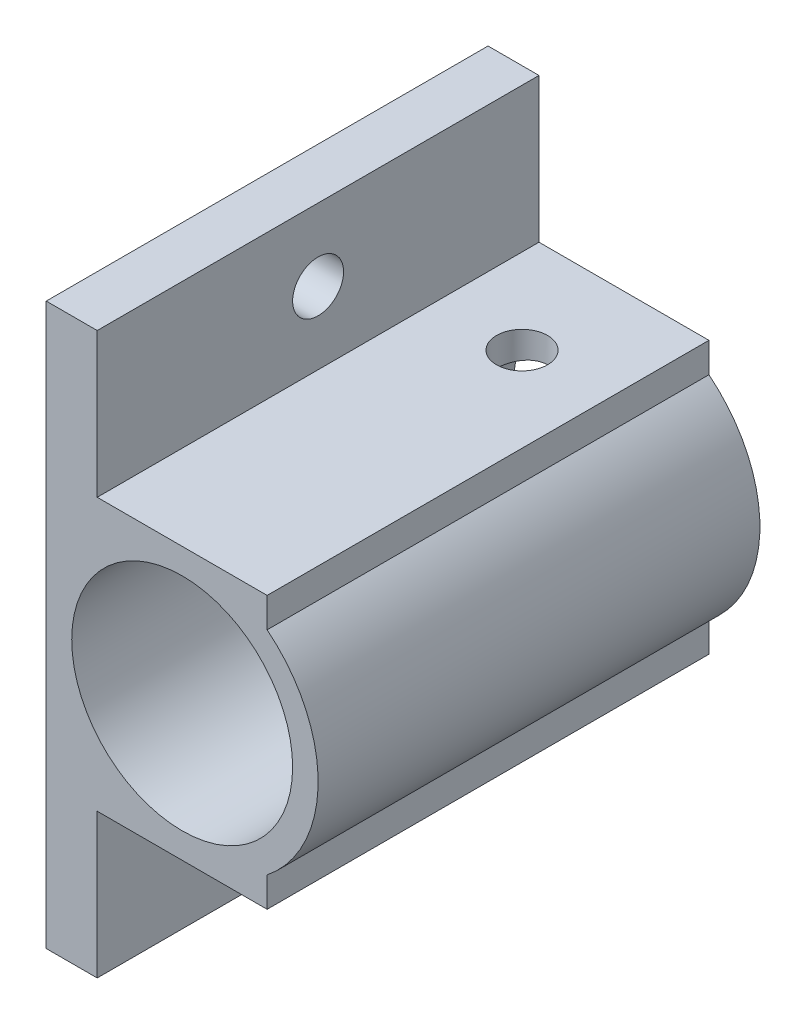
ISO-10303-21;
HEADER;
FILE_DESCRIPTION(('STEP AP214'),'2;1');
FILE_NAME('part.step','',(''),(''),'','','');
FILE_SCHEMA(('AUTOMOTIVE_DESIGN { 1 0 10303 214 1 1 1 1 }'));
ENDSEC;
DATA;
#1=APPLICATION_CONTEXT('core data for automotive mechanical design processes');
#2=APPLICATION_PROTOCOL_DEFINITION('international standard','automotive_design',2000,#1);
#3=PRODUCT_CONTEXT('',#1,'mechanical');
#4=PRODUCT('Part','Part','',(#3));
#5=PRODUCT_RELATED_PRODUCT_CATEGORY('part','',(#4));
#6=PRODUCT_DEFINITION_FORMATION('','',#4);
#7=PRODUCT_DEFINITION_CONTEXT('part definition',#1,'design');
#8=PRODUCT_DEFINITION('design','',#6,#7);
#9=PRODUCT_DEFINITION_SHAPE('','',#8);
#10=(LENGTH_UNIT() NAMED_UNIT(*) SI_UNIT(.MILLI.,.METRE.));
#11=(NAMED_UNIT(*) PLANE_ANGLE_UNIT() SI_UNIT($,.RADIAN.));
#12=(NAMED_UNIT(*) SI_UNIT($,.STERADIAN.) SOLID_ANGLE_UNIT());
#13=UNCERTAINTY_MEASURE_WITH_UNIT(LENGTH_MEASURE(1.E-05),#10,'distance_accuracy_value','');
#14=(GEOMETRIC_REPRESENTATION_CONTEXT(3) GLOBAL_UNCERTAINTY_ASSIGNED_CONTEXT((#13)) GLOBAL_UNIT_ASSIGNED_CONTEXT((#10,
#11,#12)) REPRESENTATION_CONTEXT('',''));
#15=CARTESIAN_POINT('',(0.,0.,0.));
#16=DIRECTION('',(0.,0.,1.));
#17=DIRECTION('',(1.,0.,0.));
#18=AXIS2_PLACEMENT_3D('',#15,#16,#17);
#19=CARTESIAN_POINT('',(-5.,0.,26.));
#20=DIRECTION('',(1.,0.,0.));
#21=DIRECTION('',(0.,1.,0.));
#22=AXIS2_PLACEMENT_3D('',#19,#20,#21);
#23=PLANE('',#22);
#24=CARTESIAN_POINT('',(-5.,-12.25,13.));
#25=DIRECTION('',(1.,0.,0.));
#26=DIRECTION('',(0.,1.,0.));
#27=AXIS2_PLACEMENT_3D('',#24,#25,#26);
#28=CIRCLE('',#27,1.5);
#29=CARTESIAN_POINT('',(-5.,-10.75,13.));
#30=VERTEX_POINT('',#29);
#31=EDGE_CURVE('E228',#30,#30,#28,.T.);
#32=ORIENTED_EDGE('',*,*,#31,.F.);
#33=EDGE_LOOP('',(#32));
#34=FACE_BOUND('',#33,.T.);
#35=DIRECTION('',(0.,-1.,0.));
#36=VECTOR('',#35,1.);
#37=CARTESIAN_POINT('',(-5.,0.,0.));
#38=LINE('',#37,#36);
#39=CARTESIAN_POINT('',(-5.,-8.,0.));
#40=VERTEX_POINT('',#39);
#41=CARTESIAN_POINT('',(-5.,-16.5,0.));
#42=VERTEX_POINT('',#41);
#43=EDGE_CURVE('E149',#40,#42,#38,.T.);
#44=ORIENTED_EDGE('',*,*,#43,.F.);
#45=DIRECTION('',(0.,0.,-1.));
#46=VECTOR('',#45,1.);
#47=CARTESIAN_POINT('',(-5.,-8.,26.));
#48=LINE('',#47,#46);
#49=CARTESIAN_POINT('',(-5.,-8.,26.));
#50=VERTEX_POINT('',#49);
#51=EDGE_CURVE('E11',#50,#40,#48,.T.);
#52=ORIENTED_EDGE('',*,*,#51,.F.);
#53=DIRECTION('',(0.,-1.,0.));
#54=VECTOR('',#53,1.);
#55=CARTESIAN_POINT('',(-5.,0.,26.));
#56=LINE('',#55,#54);
#57=CARTESIAN_POINT('',(-5.,-16.5,26.));
#58=VERTEX_POINT('',#57);
#59=EDGE_CURVE('E178',#50,#58,#56,.T.);
#60=ORIENTED_EDGE('',*,*,#59,.T.);
#61=DIRECTION('',(0.,0.,-1.));
#62=VECTOR('',#61,1.);
#63=CARTESIAN_POINT('',(-5.,-16.5,26.));
#64=LINE('',#63,#62);
#65=EDGE_CURVE('E54',#58,#42,#64,.T.);
#66=ORIENTED_EDGE('',*,*,#65,.T.);
#67=EDGE_LOOP('',(#44,#52,#60,#66));
#68=FACE_BOUND('',#67,.T.);
#69=ADVANCED_FACE('F36',(#34,#68),#23,.T.);
#70=CARTESIAN_POINT('',(0.,-8.,26.));
#71=DIRECTION('',(0.,1.,0.));
#72=DIRECTION('',(0.,0.,1.));
#73=AXIS2_PLACEMENT_3D('',#70,#71,#72);
#74=PLANE('',#73);
#75=DIRECTION('',(1.,0.,0.));
#76=VECTOR('',#75,1.);
#77=CARTESIAN_POINT('',(0.,-8.,0.));
#78=LINE('',#77,#76);
#79=CARTESIAN_POINT('',(5.,-8.,0.));
#80=VERTEX_POINT('',#79);
#81=EDGE_CURVE('E151',#40,#80,#78,.T.);
#82=ORIENTED_EDGE('',*,*,#81,.T.);
#83=DIRECTION('',(0.,0.,-1.));
#84=VECTOR('',#83,1.);
#85=CARTESIAN_POINT('',(5.,-8.,26.));
#86=LINE('',#85,#84);
#87=CARTESIAN_POINT('',(5.,-8.,26.));
#88=VERTEX_POINT('',#87);
#89=EDGE_CURVE('E45',#88,#80,#86,.T.);
#90=ORIENTED_EDGE('',*,*,#89,.F.);
#91=DIRECTION('',(1.,0.,0.));
#92=VECTOR('',#91,1.);
#93=CARTESIAN_POINT('',(0.,-8.,26.));
#94=LINE('',#93,#92);
#95=EDGE_CURVE('E276',#50,#88,#94,.T.);
#96=ORIENTED_EDGE('',*,*,#95,.F.);
#97=ORIENTED_EDGE('',*,*,#51,.T.);
#98=EDGE_LOOP('',(#82,#90,#96,#97));
#99=FACE_BOUND('',#98,.T.);
#100=ADVANCED_FACE('F219',(#99),#74,.F.);
#101=CARTESIAN_POINT('',(5.,0.,26.));
#102=DIRECTION('',(1.,0.,0.));
#103=DIRECTION('',(0.,1.,0.));
#104=AXIS2_PLACEMENT_3D('',#101,#102,#103);
#105=PLANE('',#104);
#106=DIRECTION('',(0.,-1.,0.));
#107=VECTOR('',#106,1.);
#108=CARTESIAN_POINT('',(5.,0.,0.));
#109=LINE('',#108,#107);
#110=CARTESIAN_POINT('',(5.,-6.2449979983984,0.));
#111=VERTEX_POINT('',#110);
#112=EDGE_CURVE('E155',#111,#80,#109,.T.);
#113=ORIENTED_EDGE('',*,*,#112,.F.);
#114=DIRECTION('',(0.,0.,-1.));
#115=VECTOR('',#114,1.);
#116=CARTESIAN_POINT('',(5.,-6.2449979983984,26.));
#117=LINE('',#116,#115);
#118=CARTESIAN_POINT('',(5.,-6.2449979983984,26.));
#119=VERTEX_POINT('',#118);
#120=EDGE_CURVE('E188',#119,#111,#117,.T.);
#121=ORIENTED_EDGE('',*,*,#120,.F.);
#122=DIRECTION('',(0.,-1.,0.));
#123=VECTOR('',#122,1.);
#124=CARTESIAN_POINT('',(5.,0.,26.));
#125=LINE('',#124,#123);
#126=EDGE_CURVE('E274',#119,#88,#125,.T.);
#127=ORIENTED_EDGE('',*,*,#126,.T.);
#128=ORIENTED_EDGE('',*,*,#89,.T.);
#129=EDGE_LOOP('',(#113,#121,#127,#128));
#130=FACE_BOUND('',#129,.T.);
#131=ADVANCED_FACE('F224',(#130),#105,.T.);
#132=CARTESIAN_POINT('',(0.,0.,26.));
#133=DIRECTION('',(0.,0.,-1.));
#134=DIRECTION('',(-1.,0.,0.));
#135=AXIS2_PLACEMENT_3D('',#132,#133,#134);
#136=CYLINDRICAL_SURFACE('',#135,8.);
#137=CARTESIAN_POINT('',(0.,0.,0.));
#138=DIRECTION('',(0.,0.,1.));
#139=DIRECTION('',(1.,0.,0.));
#140=AXIS2_PLACEMENT_3D('',#137,#138,#139);
#141=CIRCLE('',#140,8.);
#142=CARTESIAN_POINT('',(5.,6.2449979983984,0.));
#143=VERTEX_POINT('',#142);
#144=EDGE_CURVE('E158',#111,#143,#141,.T.);
#145=ORIENTED_EDGE('',*,*,#144,.T.);
#146=DIRECTION('',(0.,0.,-1.));
#147=VECTOR('',#146,1.);
#148=CARTESIAN_POINT('',(5.,6.2449979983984,26.));
#149=LINE('',#148,#147);
#150=CARTESIAN_POINT('',(5.,6.2449979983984,26.));
#151=VERTEX_POINT('',#150);
#152=EDGE_CURVE('E186',#151,#143,#149,.T.);
#153=ORIENTED_EDGE('',*,*,#152,.F.);
#154=CARTESIAN_POINT('',(0.,0.,26.));
#155=DIRECTION('',(0.,0.,1.));
#156=DIRECTION('',(1.,0.,0.));
#157=AXIS2_PLACEMENT_3D('',#154,#155,#156);
#158=CIRCLE('',#157,8.);
#159=EDGE_CURVE('E270',#119,#151,#158,.T.);
#160=ORIENTED_EDGE('',*,*,#159,.F.);
#161=ORIENTED_EDGE('',*,*,#120,.T.);
#162=EDGE_LOOP('',(#145,#153,#160,#161));
#163=FACE_BOUND('',#162,.T.);
#164=ADVANCED_FACE('F253',(#163),#136,.T.);
#165=CARTESIAN_POINT('',(5.,0.,26.));
#166=DIRECTION('',(1.,0.,0.));
#167=DIRECTION('',(0.,1.,0.));
#168=AXIS2_PLACEMENT_3D('',#165,#166,#167);
#169=PLANE('',#168);
#170=DIRECTION('',(0.,-1.,0.));
#171=VECTOR('',#170,1.);
#172=CARTESIAN_POINT('',(5.,0.,0.));
#173=LINE('',#172,#171);
#174=CARTESIAN_POINT('',(5.,8.,0.));
#175=VERTEX_POINT('',#174);
#176=EDGE_CURVE('E161',#175,#143,#173,.T.);
#177=ORIENTED_EDGE('',*,*,#176,.F.);
#178=DIRECTION('',(0.,0.,-1.));
#179=VECTOR('',#178,1.);
#180=CARTESIAN_POINT('',(5.,8.,26.));
#181=LINE('',#180,#179);
#182=CARTESIAN_POINT('',(5.,8.,26.));
#183=VERTEX_POINT('',#182);
#184=EDGE_CURVE('E184',#183,#175,#181,.T.);
#185=ORIENTED_EDGE('',*,*,#184,.F.);
#186=DIRECTION('',(0.,-1.,0.));
#187=VECTOR('',#186,1.);
#188=CARTESIAN_POINT('',(5.,0.,26.));
#189=LINE('',#188,#187);
#190=EDGE_CURVE('E273',#183,#151,#189,.T.);
#191=ORIENTED_EDGE('',*,*,#190,.T.);
#192=ORIENTED_EDGE('',*,*,#152,.T.);
#193=EDGE_LOOP('',(#177,#185,#191,#192));
#194=FACE_BOUND('',#193,.T.);
#195=ADVANCED_FACE('F249',(#194),#169,.T.);
#196=CARTESIAN_POINT('',(0.,8.,26.));
#197=DIRECTION('',(0.,1.,0.));
#198=DIRECTION('',(0.,0.,1.));
#199=AXIS2_PLACEMENT_3D('',#196,#197,#198);
#200=PLANE('',#199);
#201=CARTESIAN_POINT('',(0.,8.,6.));
#202=DIRECTION('',(0.,1.,0.));
#203=DIRECTION('',(0.,0.,1.));
#204=AXIS2_PLACEMENT_3D('',#201,#202,#203);
#205=CIRCLE('',#204,1.5);
#206=CARTESIAN_POINT('',(0.,8.,7.5));
#207=VERTEX_POINT('',#206);
#208=EDGE_CURVE('E197',#207,#207,#205,.T.);
#209=ORIENTED_EDGE('',*,*,#208,.F.);
#210=EDGE_LOOP('',(#209));
#211=FACE_BOUND('',#210,.T.);
#212=DIRECTION('',(1.,0.,0.));
#213=VECTOR('',#212,1.);
#214=CARTESIAN_POINT('',(0.,8.,0.));
#215=LINE('',#214,#213);
#216=CARTESIAN_POINT('',(-5.,8.,0.));
#217=VERTEX_POINT('',#216);
#218=EDGE_CURVE('E164',#217,#175,#215,.T.);
#219=ORIENTED_EDGE('',*,*,#218,.F.);
#220=DIRECTION('',(0.,0.,-1.));
#221=VECTOR('',#220,1.);
#222=CARTESIAN_POINT('',(-5.,8.,26.));
#223=LINE('',#222,#221);
#224=CARTESIAN_POINT('',(-5.,8.,26.));
#225=VERTEX_POINT('',#224);
#226=EDGE_CURVE('E182',#225,#217,#223,.T.);
#227=ORIENTED_EDGE('',*,*,#226,.F.);
#228=DIRECTION('',(1.,0.,0.));
#229=VECTOR('',#228,1.);
#230=CARTESIAN_POINT('',(0.,8.,26.));
#231=LINE('',#230,#229);
#232=EDGE_CURVE('E282',#225,#183,#231,.T.);
#233=ORIENTED_EDGE('',*,*,#232,.T.);
#234=ORIENTED_EDGE('',*,*,#184,.T.);
#235=EDGE_LOOP('',(#219,#227,#233,#234));
#236=FACE_BOUND('',#235,.T.);
#237=ADVANCED_FACE('F245',(#211,#236),#200,.T.);
#238=CARTESIAN_POINT('',(-5.,0.,26.));
#239=DIRECTION('',(-1.,0.,0.));
#240=DIRECTION('',(0.,-1.,0.));
#241=AXIS2_PLACEMENT_3D('',#238,#239,#240);
#242=PLANE('',#241);
#243=CARTESIAN_POINT('',(-5.,12.25,13.));
#244=DIRECTION('',(1.,0.,0.));
#245=DIRECTION('',(0.,1.,0.));
#246=AXIS2_PLACEMENT_3D('',#243,#244,#245);
#247=CIRCLE('',#246,1.5);
#248=CARTESIAN_POINT('',(-5.,13.75,13.));
#249=VERTEX_POINT('',#248);
#250=EDGE_CURVE('E292',#249,#249,#247,.T.);
#251=ORIENTED_EDGE('',*,*,#250,.F.);
#252=EDGE_LOOP('',(#251));
#253=FACE_BOUND('',#252,.T.);
#254=DIRECTION('',(0.,1.,0.));
#255=VECTOR('',#254,1.);
#256=CARTESIAN_POINT('',(-5.,0.,0.));
#257=LINE('',#256,#255);
#258=CARTESIAN_POINT('',(-5.,16.5,0.));
#259=VERTEX_POINT('',#258);
#260=EDGE_CURVE('E167',#217,#259,#257,.T.);
#261=ORIENTED_EDGE('',*,*,#260,.T.);
#262=DIRECTION('',(0.,0.,-1.));
#263=VECTOR('',#262,1.);
#264=CARTESIAN_POINT('',(-5.,16.5,26.));
#265=LINE('',#264,#263);
#266=CARTESIAN_POINT('',(-5.,16.5,26.));
#267=VERTEX_POINT('',#266);
#268=EDGE_CURVE('E138',#267,#259,#265,.T.);
#269=ORIENTED_EDGE('',*,*,#268,.F.);
#270=DIRECTION('',(0.,1.,0.));
#271=VECTOR('',#270,1.);
#272=CARTESIAN_POINT('',(-5.,0.,26.));
#273=LINE('',#272,#271);
#274=EDGE_CURVE('E126',#225,#267,#273,.T.);
#275=ORIENTED_EDGE('',*,*,#274,.F.);
#276=ORIENTED_EDGE('',*,*,#226,.T.);
#277=EDGE_LOOP('',(#261,#269,#275,#276));
#278=FACE_BOUND('',#277,.T.);
#279=ADVANCED_FACE('F242',(#253,#278),#242,.F.);
#280=CARTESIAN_POINT('',(0.,16.5,26.));
#281=DIRECTION('',(0.,-1.,0.));
#282=DIRECTION('',(0.,0.,-1.));
#283=AXIS2_PLACEMENT_3D('',#280,#281,#282);
#284=PLANE('',#283);
#285=DIRECTION('',(-1.,0.,0.));
#286=VECTOR('',#285,1.);
#287=CARTESIAN_POINT('',(0.,16.5,0.));
#288=LINE('',#287,#286);
#289=CARTESIAN_POINT('',(-8.,16.5,0.));
#290=VERTEX_POINT('',#289);
#291=EDGE_CURVE('E135',#259,#290,#288,.T.);
#292=ORIENTED_EDGE('',*,*,#291,.T.);
#293=DIRECTION('',(0.,0.,-1.));
#294=VECTOR('',#293,1.);
#295=CARTESIAN_POINT('',(-8.,16.5,26.));
#296=LINE('',#295,#294);
#297=CARTESIAN_POINT('',(-8.,16.5,26.));
#298=VERTEX_POINT('',#297);
#299=EDGE_CURVE('E132',#298,#290,#296,.T.);
#300=ORIENTED_EDGE('',*,*,#299,.F.);
#301=DIRECTION('',(-1.,0.,0.));
#302=VECTOR('',#301,1.);
#303=CARTESIAN_POINT('',(0.,16.5,26.));
#304=LINE('',#303,#302);
#305=EDGE_CURVE('E116',#267,#298,#304,.T.);
#306=ORIENTED_EDGE('',*,*,#305,.F.);
#307=ORIENTED_EDGE('',*,*,#268,.T.);
#308=EDGE_LOOP('',(#292,#300,#306,#307));
#309=FACE_BOUND('',#308,.T.);
#310=ADVANCED_FACE('F133',(#309),#284,.F.);
#311=CARTESIAN_POINT('',(-8.,0.,26.));
#312=DIRECTION('',(1.,0.,0.));
#313=DIRECTION('',(0.,1.,0.));
#314=AXIS2_PLACEMENT_3D('',#311,#312,#313);
#315=PLANE('',#314);
#316=CARTESIAN_POINT('',(-8.,12.25,13.));
#317=DIRECTION('',(1.,0.,0.));
#318=DIRECTION('',(0.,1.,0.));
#319=AXIS2_PLACEMENT_3D('',#316,#317,#318);
#320=CIRCLE('',#319,1.5);
#321=CARTESIAN_POINT('',(-8.,13.75,13.));
#322=VERTEX_POINT('',#321);
#323=EDGE_CURVE('E39',#322,#322,#320,.T.);
#324=ORIENTED_EDGE('',*,*,#323,.T.);
#325=EDGE_LOOP('',(#324));
#326=FACE_BOUND('',#325,.T.);
#327=CARTESIAN_POINT('',(-8.,-12.25,13.));
#328=DIRECTION('',(1.,0.,0.));
#329=DIRECTION('',(0.,1.,0.));
#330=AXIS2_PLACEMENT_3D('',#327,#328,#329);
#331=CIRCLE('',#330,1.5);
#332=CARTESIAN_POINT('',(-8.,-10.75,13.));
#333=VERTEX_POINT('',#332);
#334=EDGE_CURVE('E198',#333,#333,#331,.T.);
#335=ORIENTED_EDGE('',*,*,#334,.T.);
#336=EDGE_LOOP('',(#335));
#337=FACE_BOUND('',#336,.T.);
#338=DIRECTION('',(0.,-1.,0.));
#339=VECTOR('',#338,1.);
#340=CARTESIAN_POINT('',(-8.,0.,0.));
#341=LINE('',#340,#339);
#342=CARTESIAN_POINT('',(-8.,-16.5,0.));
#343=VERTEX_POINT('',#342);
#344=EDGE_CURVE('E170',#290,#343,#341,.T.);
#345=ORIENTED_EDGE('',*,*,#344,.T.);
#346=DIRECTION('',(0.,0.,-1.));
#347=VECTOR('',#346,1.);
#348=CARTESIAN_POINT('',(-8.,-16.5,26.));
#349=LINE('',#348,#347);
#350=CARTESIAN_POINT('',(-8.,-16.5,26.));
#351=VERTEX_POINT('',#350);
#352=EDGE_CURVE('E86',#351,#343,#349,.T.);
#353=ORIENTED_EDGE('',*,*,#352,.F.);
#354=DIRECTION('',(0.,-1.,0.));
#355=VECTOR('',#354,1.);
#356=CARTESIAN_POINT('',(-8.,0.,26.));
#357=LINE('',#356,#355);
#358=EDGE_CURVE('E123',#298,#351,#357,.T.);
#359=ORIENTED_EDGE('',*,*,#358,.F.);
#360=ORIENTED_EDGE('',*,*,#299,.T.);
#361=EDGE_LOOP('',(#345,#353,#359,#360));
#362=FACE_BOUND('',#361,.T.);
#363=ADVANCED_FACE('F140',(#326,#337,#362),#315,.F.);
#364=CARTESIAN_POINT('',(0.,-16.5,26.));
#365=DIRECTION('',(0.,-1.,0.));
#366=DIRECTION('',(0.,0.,-1.));
#367=AXIS2_PLACEMENT_3D('',#364,#365,#366);
#368=PLANE('',#367);
#369=DIRECTION('',(-1.,0.,0.));
#370=VECTOR('',#369,1.);
#371=CARTESIAN_POINT('',(0.,-16.5,0.));
#372=LINE('',#371,#370);
#373=EDGE_CURVE('E172',#42,#343,#372,.T.);
#374=ORIENTED_EDGE('',*,*,#373,.F.);
#375=ORIENTED_EDGE('',*,*,#65,.F.);
#376=DIRECTION('',(-1.,0.,0.));
#377=VECTOR('',#376,1.);
#378=CARTESIAN_POINT('',(0.,-16.5,26.));
#379=LINE('',#378,#377);
#380=EDGE_CURVE('E141',#58,#351,#379,.T.);
#381=ORIENTED_EDGE('',*,*,#380,.T.);
#382=ORIENTED_EDGE('',*,*,#352,.T.);
#383=EDGE_LOOP('',(#374,#375,#381,#382));
#384=FACE_BOUND('',#383,.T.);
#385=ADVANCED_FACE('F230',(#384),#368,.T.);
#386=CARTESIAN_POINT('',(0.,0.,26.));
#387=DIRECTION('',(0.,0.,-1.));
#388=DIRECTION('',(-1.,0.,0.));
#389=AXIS2_PLACEMENT_3D('',#386,#387,#388);
#390=CYLINDRICAL_SURFACE('',#389,6.5);
#391=CARTESIAN_POINT('',(0.,6.5,7.5));
#392=CARTESIAN_POINT('',(-0.0830761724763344,6.49999849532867,7.49999733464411));
#393=CARTESIAN_POINT('',(-0.166183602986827,6.49839124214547,7.49307507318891));
#394=CARTESIAN_POINT('',(-0.330029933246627,6.49213500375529,7.46560235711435));
#395=CARTESIAN_POINT('',(-0.410767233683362,6.48748401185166,7.4450429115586));
#396=CARTESIAN_POINT('',(-0.567482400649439,6.47565710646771,7.39098030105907));
#397=CARTESIAN_POINT('',(-0.643465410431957,6.46848397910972,7.35749141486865));
#398=CARTESIAN_POINT('',(-0.788732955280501,6.45238316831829,7.27856773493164));
#399=CARTESIAN_POINT('',(-0.858017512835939,6.44345549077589,7.23313298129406));
#400=CARTESIAN_POINT('',(-0.989152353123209,6.42464323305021,7.13075474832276));
#401=CARTESIAN_POINT('',(-1.05086679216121,6.41474568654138,7.07363963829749));
#402=CARTESIAN_POINT('',(-1.16393060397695,6.39519859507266,6.94989007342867));
#403=CARTESIAN_POINT('',(-1.2152789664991,6.38554907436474,6.88325469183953));
#404=CARTESIAN_POINT('',(-1.3067669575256,6.36746174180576,6.74133307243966));
#405=CARTESIAN_POINT('',(-1.34675925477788,6.35904049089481,6.66594955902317));
#406=CARTESIAN_POINT('',(-1.41345395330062,6.34455046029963,6.50930490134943));
#407=CARTESIAN_POINT('',(-1.44015813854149,6.33848136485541,6.4280445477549));
#408=CARTESIAN_POINT('',(-1.4790642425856,6.32951534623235,6.26343419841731));
#409=CARTESIAN_POINT('',(-1.49150809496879,6.32656557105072,6.1801443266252));
#410=CARTESIAN_POINT('',(-1.50229307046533,6.32401364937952,6.01261091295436));
#411=CARTESIAN_POINT('',(-1.50063613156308,6.32441104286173,5.92836750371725));
#412=CARTESIAN_POINT('',(-1.48346063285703,6.32846083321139,5.7631371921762));
#413=CARTESIAN_POINT('',(-1.46822575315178,6.33204661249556,5.68211891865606));
#414=CARTESIAN_POINT('',(-1.42477741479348,6.34196351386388,5.52382020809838));
#415=CARTESIAN_POINT('',(-1.39656315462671,6.34829480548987,5.44654000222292));
#416=CARTESIAN_POINT('',(-1.32770349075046,6.36305332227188,5.29712732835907));
#417=CARTESIAN_POINT('',(-1.28695129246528,6.37149843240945,5.22504591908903));
#418=CARTESIAN_POINT('',(-1.19424748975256,6.38952239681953,5.08864076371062));
#419=CARTESIAN_POINT('',(-1.1422941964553,6.39910142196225,5.02431818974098));
#420=CARTESIAN_POINT('',(-1.02717321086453,6.41859777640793,4.90362604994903));
#421=CARTESIAN_POINT('',(-0.963764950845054,6.42851768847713,4.84748611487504));
#422=CARTESIAN_POINT('',(-0.828318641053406,6.44736816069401,4.74659692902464));
#423=CARTESIAN_POINT('',(-0.75628039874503,6.45629869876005,4.70184793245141));
#424=CARTESIAN_POINT('',(-0.605321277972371,6.47219854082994,4.62494408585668));
#425=CARTESIAN_POINT('',(-0.526383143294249,6.47916273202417,4.59282198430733));
#426=CARTESIAN_POINT('',(-0.364032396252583,6.49030757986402,4.54236385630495));
#427=CARTESIAN_POINT('',(-0.280620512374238,6.49448868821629,4.52402559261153));
#428=CARTESIAN_POINT('',(-0.11365732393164,6.49953102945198,4.50199584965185));
#429=CARTESIAN_POINT('',(-0.030149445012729,6.50046326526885,4.49799106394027));
#430=CARTESIAN_POINT('',(0.136342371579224,6.49910299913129,4.50388901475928));
#431=CARTESIAN_POINT('',(0.219326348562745,6.49681074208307,4.513790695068));
#432=CARTESIAN_POINT('',(0.381357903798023,6.48930412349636,4.54696119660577));
#433=CARTESIAN_POINT('',(0.4604414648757,6.48412623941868,4.57006324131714));
#434=CARTESIAN_POINT('',(0.613609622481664,6.47142910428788,4.62879158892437));
#435=CARTESIAN_POINT('',(0.687693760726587,6.4639096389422,4.66441903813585));
#436=CARTESIAN_POINT('',(0.830037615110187,6.44718996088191,4.74782264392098));
#437=CARTESIAN_POINT('',(0.898188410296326,6.43796535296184,4.7957796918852));
#438=CARTESIAN_POINT('',(1.02558718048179,6.41890391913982,4.90224561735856));
#439=CARTESIAN_POINT('',(1.08483385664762,6.40906700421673,4.96075603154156));
#440=CARTESIAN_POINT('',(1.19400102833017,6.38964047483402,5.08811238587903));
#441=CARTESIAN_POINT('',(1.24370343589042,6.3800601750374,5.1571469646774));
#442=CARTESIAN_POINT('',(1.33081235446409,6.36246188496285,5.30276588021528));
#443=CARTESIAN_POINT('',(1.3682194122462,6.35444382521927,5.37934988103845));
#444=CARTESIAN_POINT('',(1.42941066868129,6.34095951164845,5.53747598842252));
#445=CARTESIAN_POINT('',(1.45327404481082,6.33547846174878,5.61898612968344));
#446=CARTESIAN_POINT('',(1.48692530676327,6.3276660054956,5.78500399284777));
#447=CARTESIAN_POINT('',(1.49671574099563,6.32533402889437,5.86951116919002));
#448=CARTESIAN_POINT('',(1.50182536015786,6.32412253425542,6.03691822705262));
#449=CARTESIAN_POINT('',(1.49749127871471,6.32516029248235,6.11980711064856));
#450=CARTESIAN_POINT('',(1.47525685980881,6.33038270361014,6.28363867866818));
#451=CARTESIAN_POINT('',(1.45735672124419,6.33456731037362,6.36458139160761));
#452=CARTESIAN_POINT('',(1.40867420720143,6.34556939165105,6.52190991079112));
#453=CARTESIAN_POINT('',(1.37794771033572,6.35237543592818,6.59831386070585));
#454=CARTESIAN_POINT('',(1.304530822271,6.36785683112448,6.74493180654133));
#455=CARTESIAN_POINT('',(1.26183902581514,6.37653240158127,6.81514507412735));
#456=CARTESIAN_POINT('',(1.16457679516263,6.39501829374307,6.94908552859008));
#457=CARTESIAN_POINT('',(1.10976162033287,6.4048496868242,7.01263211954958));
#458=CARTESIAN_POINT('',(0.990297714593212,6.42440402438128,7.12973824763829));
#459=CARTESIAN_POINT('',(0.925646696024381,6.43412694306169,7.18329545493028));
#460=CARTESIAN_POINT('',(0.787191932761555,6.45253999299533,7.27966726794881));
#461=CARTESIAN_POINT('',(0.713266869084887,6.46121270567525,7.32231111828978));
#462=CARTESIAN_POINT('',(0.559109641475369,6.47637045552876,7.39449914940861));
#463=CARTESIAN_POINT('',(0.478882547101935,6.48285722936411,7.42405373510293));
#464=CARTESIAN_POINT('',(0.332210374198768,6.49182723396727,7.46427847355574));
#465=CARTESIAN_POINT('',(0.266526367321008,6.49487228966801,7.477647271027));
#466=CARTESIAN_POINT('',(0.133901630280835,6.4989592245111,7.49550886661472));
#467=CARTESIAN_POINT('',(0.0669609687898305,6.5000012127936,7.50000214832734));
#468=CARTESIAN_POINT('',(0.,6.5,7.5));
#469=B_SPLINE_CURVE_WITH_KNOTS('',3,(#391,#392,#393,#394,#395,#396,#397,#398,#399,#400,#401,
#402,#403,#404,#405,#406,#407,#408,#409,#410,#411,#412,#413,#414,#415,#416,#417,#418,#419,#420,
#421,#422,#423,#424,#425,#426,#427,#428,#429,#430,#431,#432,#433,#434,#435,#436,#437,#438,#439,
#440,#441,#442,#443,#444,#445,#446,#447,#448,#449,#450,#451,#452,#453,#454,#455,#456,#457,#458,
#459,#460,#461,#462,#463,#464,#465,#466,#467,#468),.UNSPECIFIED.,.T.,.F.,(4,2,2,2,2,2,2,2,2,2,2,
2,2,2,2,2,2,2,2,2,2,2,2,2,2,2,2,2,2,2,2,2,2,2,2,2,2,2,4),(0.,0.248983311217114,
0.498130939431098,0.747004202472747,0.995876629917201,1.24870930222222,1.50156660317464,
1.75756840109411,2.0135358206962,2.26509316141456,2.51661592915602,2.76300377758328,
3.00940684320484,3.25796969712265,3.50657005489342,3.7611752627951,4.01578615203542,
4.27105309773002,4.52627860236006,4.77589001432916,5.02548246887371,5.27198911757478,
5.51851833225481,5.76889433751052,6.01930682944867,6.27489540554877,6.53047261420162,
6.7845398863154,7.03856114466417,7.28639401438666,7.53422325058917,7.78098389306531,
8.02777352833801,8.28009323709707,8.53247172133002,8.78858609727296,9.04449651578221,
9.24519271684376,9.44587798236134),.UNSPECIFIED.);
#470=CARTESIAN_POINT('',(0.,6.5,7.5));
#471=VERTEX_POINT('',#470);
#472=EDGE_CURVE('E152',#471,#471,#469,.T.);
#473=ORIENTED_EDGE('',*,*,#472,.F.);
#474=EDGE_LOOP('',(#473));
#475=FACE_BOUND('',#474,.T.);
#476=CARTESIAN_POINT('',(0.,0.,26.));
#477=DIRECTION('',(0.,0.,1.));
#478=DIRECTION('',(1.,0.,0.));
#479=AXIS2_PLACEMENT_3D('',#476,#477,#478);
#480=CIRCLE('',#479,6.5);
#481=CARTESIAN_POINT('',(6.5,0.,26.));
#482=VERTEX_POINT('',#481);
#483=EDGE_CURVE('E143',#482,#482,#480,.T.);
#484=ORIENTED_EDGE('',*,*,#483,.T.);
#485=EDGE_LOOP('',(#484));
#486=FACE_BOUND('',#485,.T.);
#487=CARTESIAN_POINT('',(0.,0.,0.));
#488=DIRECTION('',(0.,0.,1.));
#489=DIRECTION('',(1.,0.,0.));
#490=AXIS2_PLACEMENT_3D('',#487,#488,#489);
#491=CIRCLE('',#490,6.5);
#492=CARTESIAN_POINT('',(6.5,0.,0.));
#493=VERTEX_POINT('',#492);
#494=EDGE_CURVE('E175',#493,#493,#491,.T.);
#495=ORIENTED_EDGE('',*,*,#494,.F.);
#496=EDGE_LOOP('',(#495));
#497=FACE_BOUND('',#496,.T.);
#498=ADVANCED_FACE('F199',(#475,#486,#497),#390,.F.);
#499=CARTESIAN_POINT('',(0.,0.,26.));
#500=DIRECTION('',(0.,0.,1.));
#501=DIRECTION('',(1.,0.,0.));
#502=AXIS2_PLACEMENT_3D('',#499,#500,#501);
#503=PLANE('',#502);
#504=ORIENTED_EDGE('',*,*,#59,.F.);
#505=ORIENTED_EDGE('',*,*,#95,.T.);
#506=ORIENTED_EDGE('',*,*,#126,.F.);
#507=ORIENTED_EDGE('',*,*,#159,.T.);
#508=ORIENTED_EDGE('',*,*,#190,.F.);
#509=ORIENTED_EDGE('',*,*,#232,.F.);
#510=ORIENTED_EDGE('',*,*,#274,.T.);
#511=ORIENTED_EDGE('',*,*,#305,.T.);
#512=ORIENTED_EDGE('',*,*,#358,.T.);
#513=ORIENTED_EDGE('',*,*,#380,.F.);
#514=EDGE_LOOP('',(#504,#505,#506,#507,#508,#509,#510,#511,#512,#513));
#515=FACE_BOUND('',#514,.T.);
#516=ORIENTED_EDGE('',*,*,#483,.F.);
#517=EDGE_LOOP('',(#516));
#518=FACE_BOUND('',#517,.T.);
#519=ADVANCED_FACE('F119',(#515,#518),#503,.T.);
#520=CARTESIAN_POINT('',(0.,0.,0.));
#521=DIRECTION('',(0.,0.,1.));
#522=DIRECTION('',(1.,0.,0.));
#523=AXIS2_PLACEMENT_3D('',#520,#521,#522);
#524=PLANE('',#523);
#525=ORIENTED_EDGE('',*,*,#43,.T.);
#526=ORIENTED_EDGE('',*,*,#373,.T.);
#527=ORIENTED_EDGE('',*,*,#344,.F.);
#528=ORIENTED_EDGE('',*,*,#291,.F.);
#529=ORIENTED_EDGE('',*,*,#260,.F.);
#530=ORIENTED_EDGE('',*,*,#218,.T.);
#531=ORIENTED_EDGE('',*,*,#176,.T.);
#532=ORIENTED_EDGE('',*,*,#144,.F.);
#533=ORIENTED_EDGE('',*,*,#112,.T.);
#534=ORIENTED_EDGE('',*,*,#81,.F.);
#535=EDGE_LOOP('',(#525,#526,#527,#528,#529,#530,#531,#532,#533,#534));
#536=FACE_BOUND('',#535,.T.);
#537=ORIENTED_EDGE('',*,*,#494,.T.);
#538=EDGE_LOOP('',(#537));
#539=FACE_BOUND('',#538,.T.);
#540=ADVANCED_FACE('F209',(#536,#539),#524,.F.);
#541=CARTESIAN_POINT('',(0.,4.,6.));
#542=DIRECTION('',(0.,1.,0.));
#543=DIRECTION('',(0.,0.,1.));
#544=AXIS2_PLACEMENT_3D('',#541,#542,#543);
#545=CYLINDRICAL_SURFACE('',#544,1.5);
#546=ORIENTED_EDGE('',*,*,#472,.T.);
#547=EDGE_LOOP('',(#546));
#548=FACE_BOUND('',#547,.T.);
#549=ORIENTED_EDGE('',*,*,#208,.T.);
#550=EDGE_LOOP('',(#549));
#551=FACE_BOUND('',#550,.T.);
#552=ADVANCED_FACE('F203',(#548,#551),#545,.F.);
#553=CARTESIAN_POINT('',(-9.,-12.25,13.));
#554=DIRECTION('',(1.,0.,0.));
#555=DIRECTION('',(0.,1.,0.));
#556=AXIS2_PLACEMENT_3D('',#553,#554,#555);
#557=CYLINDRICAL_SURFACE('',#556,1.5);
#558=ORIENTED_EDGE('',*,*,#31,.T.);
#559=EDGE_LOOP('',(#558));
#560=FACE_BOUND('',#559,.T.);
#561=ORIENTED_EDGE('',*,*,#334,.F.);
#562=EDGE_LOOP('',(#561));
#563=FACE_BOUND('',#562,.T.);
#564=ADVANCED_FACE('F208',(#560,#563),#557,.F.);
#565=CARTESIAN_POINT('',(-9.,12.25,13.));
#566=DIRECTION('',(1.,0.,0.));
#567=DIRECTION('',(0.,1.,0.));
#568=AXIS2_PLACEMENT_3D('',#565,#566,#567);
#569=CYLINDRICAL_SURFACE('',#568,1.5);
#570=ORIENTED_EDGE('',*,*,#250,.T.);
#571=EDGE_LOOP('',(#570));
#572=FACE_BOUND('',#571,.T.);
#573=ORIENTED_EDGE('',*,*,#323,.F.);
#574=EDGE_LOOP('',(#573));
#575=FACE_BOUND('',#574,.T.);
#576=ADVANCED_FACE('F302',(#572,#575),#569,.F.);
#577=CLOSED_SHELL('',(#69,#100,#131,#164,#195,#237,#279,#310,#363,#385,#498,#519,#540,#552,#564,#576));
#578=MANIFOLD_SOLID_BREP('B2',#577);
#579=ADVANCED_BREP_SHAPE_REPRESENTATION('',(#18,#578),#14);
#580=SHAPE_DEFINITION_REPRESENTATION(#9,#579);
ENDSEC;
END-ISO-10303-21;
